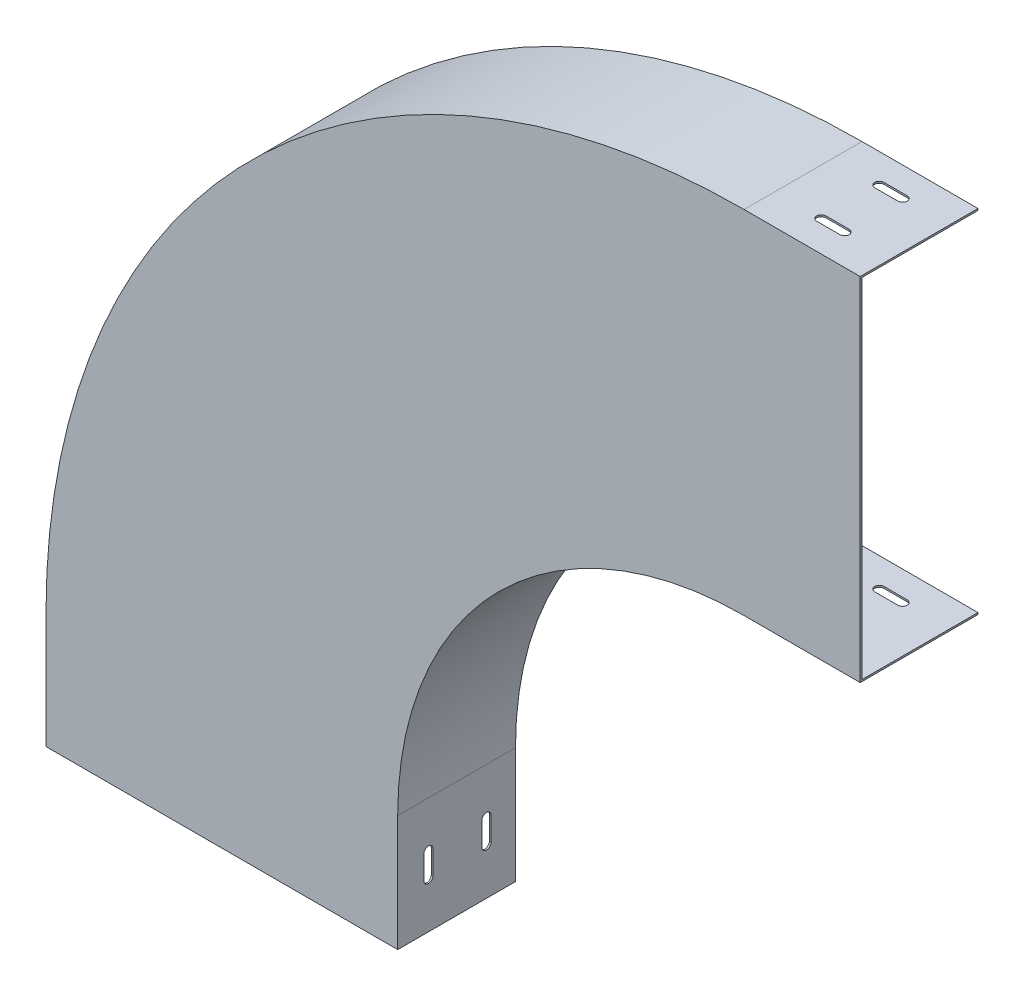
from build123d import *

# Parameters (mm, degrees)
CUT_EXTRUDE1_DEPTH      = 785.219357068
CUT_EXTRUDE1_DEPTH_BACK = 785.219357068
CUT_EXTRUDE2_DEPTH      = 785.219357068
CUT_EXTRUDE2_DEPTH_BACK = 785.219357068


with BuildPart() as part:
    # Sweep1: sweep along a path in ElbowArc
    with BuildLine(Plane.XY) as sweep1_path:
        Line((550, 0), (450, 0))
        ThreePointArc((450, 0), (131.801948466, -131.801948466), (0, -450))
        Line((0, -450), (0, -550))
    # Sketch1 → Sweep1 (sweep)
    with BuildSketch(Plane(origin=(0, -550, 0), x_dir=(1, 0, 0), z_dir=(0, 1, 0))):
        Polygon((150, 0), (-150, 0), (-150, 100), (-151.5, 100), (-151.5, -1.5), (151.5, -1.5), (151.5, 100), (150, 100), align=None)
    sweep(path=sweep1_path.line)

    # Sketch2 → Cut-Extrude1 (cut, two sides: drawn at the far end of the back side and taken through both)
    with BuildSketch(Plane(origin=(0, 0, 0), x_dir=(0, 0, -1), z_dir=(1, 0, 0)).offset(-CUT_EXTRUDE1_DEPTH_BACK)):
        with BuildLine():
            Line((21, -510), (21, -490))
            ThreePointArc((21, -490), (25, -486), (29, -490))
            Line((29, -490), (29, -510))
            ThreePointArc((29, -510), (25, -514), (21, -510))
        make_face()
        with BuildLine():
            Line((71, -510), (71, -490))
            ThreePointArc((71, -490), (75, -486), (79, -490))
            Line((79, -490), (79, -510))
            ThreePointArc((79, -510), (75, -514), (71, -510))
        make_face()
    extrude(amount=CUT_EXTRUDE1_DEPTH + CUT_EXTRUDE1_DEPTH_BACK, mode=Mode.SUBTRACT)

    # Sketch3 → Cut-Extrude2 (cut, two sides: drawn at the far end of the back side and taken through both)
    with BuildSketch(Plane(origin=(0, 0, 0), x_dir=(-1, 0, 0), z_dir=(0, -1, 0)).offset(-CUT_EXTRUDE2_DEPTH_BACK)):
        with BuildLine():
            Line((-510, 79), (-490, 79))
            ThreePointArc((-490, 79), (-486, 75), (-490, 71))
            Line((-490, 71), (-510, 71))
            ThreePointArc((-510, 71), (-514, 75), (-510, 79))
        make_face()
        with BuildLine():
            Line((-510, 29), (-490, 29))
            ThreePointArc((-490, 29), (-486, 25), (-490, 21))
            Line((-490, 21), (-510, 21))
            ThreePointArc((-510, 21), (-514, 25), (-510, 29))
        make_face()
    extrude(amount=CUT_EXTRUDE2_DEPTH + CUT_EXTRUDE2_DEPTH_BACK, mode=Mode.SUBTRACT)


solid = part.part
